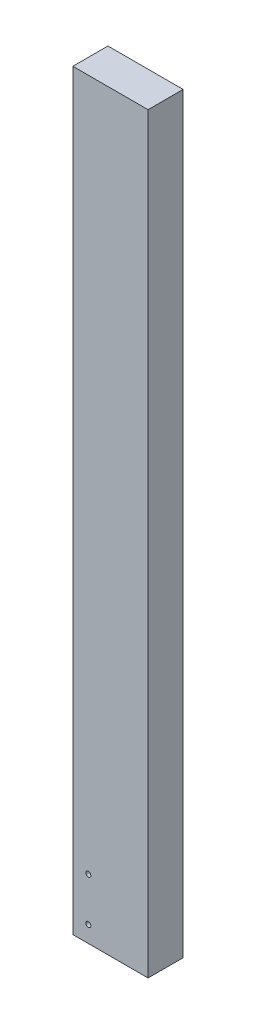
ISO-10303-21;
HEADER;
FILE_DESCRIPTION(('STEP AP214'),'2;1');
FILE_NAME('part.step','',(''),(''),'','','');
FILE_SCHEMA(('AUTOMOTIVE_DESIGN { 1 0 10303 214 1 1 1 1 }'));
ENDSEC;
DATA;
#1=APPLICATION_CONTEXT('core data for automotive mechanical design processes');
#2=APPLICATION_PROTOCOL_DEFINITION('international standard','automotive_design',2000,#1);
#3=PRODUCT_CONTEXT('',#1,'mechanical');
#4=PRODUCT('Part','Part','',(#3));
#5=PRODUCT_RELATED_PRODUCT_CATEGORY('part','',(#4));
#6=PRODUCT_DEFINITION_FORMATION('','',#4);
#7=PRODUCT_DEFINITION_CONTEXT('part definition',#1,'design');
#8=PRODUCT_DEFINITION('design','',#6,#7);
#9=PRODUCT_DEFINITION_SHAPE('','',#8);
#10=(LENGTH_UNIT() NAMED_UNIT(*) SI_UNIT(.MILLI.,.METRE.));
#11=(NAMED_UNIT(*) PLANE_ANGLE_UNIT() SI_UNIT($,.RADIAN.));
#12=(NAMED_UNIT(*) SI_UNIT($,.STERADIAN.) SOLID_ANGLE_UNIT());
#13=UNCERTAINTY_MEASURE_WITH_UNIT(LENGTH_MEASURE(1.E-05),#10,'distance_accuracy_value','');
#14=(GEOMETRIC_REPRESENTATION_CONTEXT(3) GLOBAL_UNCERTAINTY_ASSIGNED_CONTEXT((#13)) GLOBAL_UNIT_ASSIGNED_CONTEXT((#10,
#11,#12)) REPRESENTATION_CONTEXT('',''));
#15=CARTESIAN_POINT('',(0.,0.,0.));
#16=DIRECTION('',(0.,0.,1.));
#17=DIRECTION('',(1.,0.,0.));
#18=AXIS2_PLACEMENT_3D('',#15,#16,#17);
#19=CARTESIAN_POINT('',(-4.52462285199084,15.7611857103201,12.7));
#20=DIRECTION('',(0.,0.,1.));
#21=DIRECTION('',(1.,0.,0.));
#22=AXIS2_PLACEMENT_3D('',#19,#20,#21);
#23=PLANE('',#22);
#24=CARTESIAN_POINT('',(-4.52462285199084,15.7611857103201,12.7));
#25=DIRECTION('',(0.,0.,-1.));
#26=DIRECTION('',(-1.,0.,0.));
#27=AXIS2_PLACEMENT_3D('',#24,#25,#26);
#28=CIRCLE('',#27,1.27000000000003);
#29=CARTESIAN_POINT('',(-5.79462285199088,15.7611857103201,12.7));
#30=VERTEX_POINT('',#29);
#31=EDGE_CURVE('E19',#30,#30,#28,.T.);
#32=ORIENTED_EDGE('',*,*,#31,.T.);
#33=EDGE_LOOP('',(#32));
#34=FACE_BOUND('',#33,.T.);
#35=ADVANCED_FACE('F16',(#34),#23,.F.);
#36=CARTESIAN_POINT('',(-4.52462285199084,166.975093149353,12.7));
#37=DIRECTION('',(0.,0.,1.));
#38=DIRECTION('',(1.,0.,0.));
#39=AXIS2_PLACEMENT_3D('',#36,#37,#38);
#40=PLANE('',#39);
#41=CARTESIAN_POINT('',(-4.52462285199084,166.975093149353,12.7));
#42=DIRECTION('',(0.,0.,-1.));
#43=DIRECTION('',(-1.,0.,0.));
#44=AXIS2_PLACEMENT_3D('',#41,#42,#43);
#45=CIRCLE('',#44,1.27000000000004);
#46=CARTESIAN_POINT('',(-5.79462285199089,166.975093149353,12.7));
#47=VERTEX_POINT('',#46);
#48=EDGE_CURVE('E106',#47,#47,#45,.T.);
#49=ORIENTED_EDGE('',*,*,#48,.T.);
#50=EDGE_LOOP('',(#49));
#51=FACE_BOUND('',#50,.T.);
#52=ADVANCED_FACE('F128',(#51),#40,.F.);
#53=CARTESIAN_POINT('',(-4.52462285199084,316.866822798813,12.7));
#54=DIRECTION('',(0.,0.,1.));
#55=DIRECTION('',(1.,0.,0.));
#56=AXIS2_PLACEMENT_3D('',#53,#54,#55);
#57=PLANE('',#56);
#58=CARTESIAN_POINT('',(-4.52462285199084,316.866822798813,12.7));
#59=DIRECTION('',(0.,0.,-1.));
#60=DIRECTION('',(-1.,0.,0.));
#61=AXIS2_PLACEMENT_3D('',#58,#59,#60);
#62=CIRCLE('',#61,1.27000000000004);
#63=CARTESIAN_POINT('',(-5.79462285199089,316.866822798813,12.7));
#64=VERTEX_POINT('',#63);
#65=EDGE_CURVE('E104',#64,#64,#62,.T.);
#66=ORIENTED_EDGE('',*,*,#65,.T.);
#67=EDGE_LOOP('',(#66));
#68=FACE_BOUND('',#67,.T.);
#69=ADVANCED_FACE('F117',(#68),#57,.F.);
#70=CARTESIAN_POINT('',(-4.52462285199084,15.7611857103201,12.7));
#71=DIRECTION('',(0.,0.,-1.));
#72=DIRECTION('',(-1.,0.,0.));
#73=AXIS2_PLACEMENT_3D('',#70,#71,#72);
#74=CYLINDRICAL_SURFACE('',#73,1.27000000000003);
#75=CARTESIAN_POINT('',(-4.52462285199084,15.7611857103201,6.096));
#76=DIRECTION('',(0.,0.,-1.));
#77=DIRECTION('',(-1.,0.,0.));
#78=AXIS2_PLACEMENT_3D('',#75,#76,#77);
#79=CIRCLE('',#78,1.27000000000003);
#80=CARTESIAN_POINT('',(-5.79462285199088,15.7611857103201,6.096));
#81=VERTEX_POINT('',#80);
#82=EDGE_CURVE('E101',#81,#81,#79,.T.);
#83=ORIENTED_EDGE('',*,*,#82,.T.);
#84=EDGE_LOOP('',(#83));
#85=FACE_BOUND('',#84,.T.);
#86=ORIENTED_EDGE('',*,*,#31,.F.);
#87=EDGE_LOOP('',(#86));
#88=FACE_BOUND('',#87,.T.);
#89=ADVANCED_FACE('F114',(#85,#88),#74,.F.);
#90=CARTESIAN_POINT('',(-4.52462285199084,166.975093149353,12.7));
#91=DIRECTION('',(0.,0.,-1.));
#92=DIRECTION('',(-1.,0.,0.));
#93=AXIS2_PLACEMENT_3D('',#90,#91,#92);
#94=CYLINDRICAL_SURFACE('',#93,1.27000000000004);
#95=CARTESIAN_POINT('',(-4.52462285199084,166.975093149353,6.096));
#96=DIRECTION('',(0.,0.,-1.));
#97=DIRECTION('',(-1.,0.,0.));
#98=AXIS2_PLACEMENT_3D('',#95,#96,#97);
#99=CIRCLE('',#98,1.27000000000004);
#100=CARTESIAN_POINT('',(-5.79462285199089,166.975093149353,6.096));
#101=VERTEX_POINT('',#100);
#102=EDGE_CURVE('E98',#101,#101,#99,.T.);
#103=ORIENTED_EDGE('',*,*,#102,.T.);
#104=EDGE_LOOP('',(#103));
#105=FACE_BOUND('',#104,.T.);
#106=ORIENTED_EDGE('',*,*,#48,.F.);
#107=EDGE_LOOP('',(#106));
#108=FACE_BOUND('',#107,.T.);
#109=ADVANCED_FACE('F116',(#105,#108),#94,.F.);
#110=CARTESIAN_POINT('',(-4.52462285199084,316.866822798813,12.7));
#111=DIRECTION('',(0.,0.,-1.));
#112=DIRECTION('',(-1.,0.,0.));
#113=AXIS2_PLACEMENT_3D('',#110,#111,#112);
#114=CYLINDRICAL_SURFACE('',#113,1.27000000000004);
#115=CARTESIAN_POINT('',(-4.52462285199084,316.866822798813,6.096));
#116=DIRECTION('',(0.,0.,-1.));
#117=DIRECTION('',(-1.,0.,0.));
#118=AXIS2_PLACEMENT_3D('',#115,#116,#117);
#119=CIRCLE('',#118,1.27000000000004);
#120=CARTESIAN_POINT('',(-5.79462285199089,316.866822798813,6.096));
#121=VERTEX_POINT('',#120);
#122=EDGE_CURVE('E95',#121,#121,#119,.T.);
#123=ORIENTED_EDGE('',*,*,#122,.T.);
#124=EDGE_LOOP('',(#123));
#125=FACE_BOUND('',#124,.T.);
#126=ORIENTED_EDGE('',*,*,#65,.F.);
#127=EDGE_LOOP('',(#126));
#128=FACE_BOUND('',#127,.T.);
#129=ADVANCED_FACE('F125',(#125,#128),#114,.F.);
#130=CARTESIAN_POINT('',(0.,0.,6.096));
#131=DIRECTION('',(0.,0.,1.));
#132=DIRECTION('',(1.,0.,0.));
#133=AXIS2_PLACEMENT_3D('',#130,#131,#132);
#134=PLANE('',#133);
#135=DIRECTION('',(0.,1.,0.));
#136=VECTOR('',#135,1.);
#137=CARTESIAN_POINT('',(-19.7646228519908,0.,6.096));
#138=LINE('',#137,#136);
#139=CARTESIAN_POINT('',(-19.7646228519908,-28.2477880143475,6.096));
#140=VERTEX_POINT('',#139);
#141=CARTESIAN_POINT('',(-19.7646228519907,352.752211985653,6.096));
#142=VERTEX_POINT('',#141);
#143=EDGE_CURVE('E89',#140,#142,#138,.T.);
#144=ORIENTED_EDGE('',*,*,#143,.T.);
#145=DIRECTION('',(1.,0.,0.));
#146=VECTOR('',#145,1.);
#147=CARTESIAN_POINT('',(0.,352.752211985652,6.096));
#148=LINE('',#147,#146);
#149=CARTESIAN_POINT('',(18.3353771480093,352.752211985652,6.096));
#150=VERTEX_POINT('',#149);
#151=EDGE_CURVE('E54',#150,#142,#148,.F.);
#152=ORIENTED_EDGE('',*,*,#151,.F.);
#153=DIRECTION('',(0.,1.,0.));
#154=VECTOR('',#153,1.);
#155=CARTESIAN_POINT('',(18.3353771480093,0.,6.096));
#156=LINE('',#155,#154);
#157=CARTESIAN_POINT('',(18.3353771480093,-28.2477880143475,6.096));
#158=VERTEX_POINT('',#157);
#159=EDGE_CURVE('E69',#150,#158,#156,.F.);
#160=ORIENTED_EDGE('',*,*,#159,.T.);
#161=DIRECTION('',(1.,0.,0.));
#162=VECTOR('',#161,1.);
#163=CARTESIAN_POINT('',(0.,-28.2477880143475,6.096));
#164=LINE('',#163,#162);
#165=EDGE_CURVE('E59',#158,#140,#164,.F.);
#166=ORIENTED_EDGE('',*,*,#165,.T.);
#167=EDGE_LOOP('',(#144,#152,#160,#166));
#168=FACE_BOUND('',#167,.T.);
#169=ORIENTED_EDGE('',*,*,#122,.F.);
#170=EDGE_LOOP('',(#169));
#171=FACE_BOUND('',#170,.T.);
#172=ORIENTED_EDGE('',*,*,#102,.F.);
#173=EDGE_LOOP('',(#172));
#174=FACE_BOUND('',#173,.T.);
#175=ORIENTED_EDGE('',*,*,#82,.F.);
#176=EDGE_LOOP('',(#175));
#177=FACE_BOUND('',#176,.T.);
#178=CARTESIAN_POINT('',(-11.9248315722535,-19.8788329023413,6.096));
#179=DIRECTION('',(0.,0.,-1.));
#180=DIRECTION('',(-1.,0.,0.));
#181=AXIS2_PLACEMENT_3D('',#178,#179,#180);
#182=CIRCLE('',#181,1.27);
#183=CARTESIAN_POINT('',(-13.1948315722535,-19.8788329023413,6.096));
#184=VERTEX_POINT('',#183);
#185=EDGE_CURVE('E67',#184,#184,#182,.F.);
#186=ORIENTED_EDGE('',*,*,#185,.T.);
#187=EDGE_LOOP('',(#186));
#188=FACE_BOUND('',#187,.T.);
#189=CARTESIAN_POINT('',(-11.9248315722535,2.18597142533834,6.096));
#190=DIRECTION('',(0.,0.,-1.));
#191=DIRECTION('',(-1.,0.,0.));
#192=AXIS2_PLACEMENT_3D('',#189,#190,#191);
#193=CIRCLE('',#192,1.27);
#194=CARTESIAN_POINT('',(-13.1948315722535,2.18597142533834,6.096));
#195=VERTEX_POINT('',#194);
#196=EDGE_CURVE('E92',#195,#195,#193,.F.);
#197=ORIENTED_EDGE('',*,*,#196,.T.);
#198=EDGE_LOOP('',(#197));
#199=FACE_BOUND('',#198,.T.);
#200=ADVANCED_FACE('F70',(#168,#171,#174,#177,#188,#199),#134,.F.);
#201=CARTESIAN_POINT('',(-11.9248315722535,2.18597142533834,35.56));
#202=DIRECTION('',(0.,0.,-1.));
#203=DIRECTION('',(-1.,0.,0.));
#204=AXIS2_PLACEMENT_3D('',#201,#202,#203);
#205=CYLINDRICAL_SURFACE('',#204,1.27);
#206=CARTESIAN_POINT('',(-11.9248315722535,2.18597142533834,23.876));
#207=DIRECTION('',(0.,0.,-1.));
#208=DIRECTION('',(-1.,0.,0.));
#209=AXIS2_PLACEMENT_3D('',#206,#207,#208);
#210=CIRCLE('',#209,1.27);
#211=CARTESIAN_POINT('',(-13.1948315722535,2.18597142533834,23.876));
#212=VERTEX_POINT('',#211);
#213=EDGE_CURVE('E86',#212,#212,#210,.T.);
#214=ORIENTED_EDGE('',*,*,#213,.F.);
#215=EDGE_LOOP('',(#214));
#216=FACE_BOUND('',#215,.T.);
#217=ORIENTED_EDGE('',*,*,#196,.F.);
#218=EDGE_LOOP('',(#217));
#219=FACE_BOUND('',#218,.T.);
#220=ADVANCED_FACE('F154',(#216,#219),#205,.F.);
#221=CARTESIAN_POINT('',(-11.9248315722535,-19.8788329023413,35.56));
#222=DIRECTION('',(0.,0.,-1.));
#223=DIRECTION('',(-1.,0.,0.));
#224=AXIS2_PLACEMENT_3D('',#221,#222,#223);
#225=CYLINDRICAL_SURFACE('',#224,1.27);
#226=CARTESIAN_POINT('',(-11.9248315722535,-19.8788329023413,23.876));
#227=DIRECTION('',(0.,0.,-1.));
#228=DIRECTION('',(-1.,0.,0.));
#229=AXIS2_PLACEMENT_3D('',#226,#227,#228);
#230=CIRCLE('',#229,1.27);
#231=CARTESIAN_POINT('',(-13.1948315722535,-19.8788329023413,23.876));
#232=VERTEX_POINT('',#231);
#233=EDGE_CURVE('E82',#232,#232,#230,.T.);
#234=ORIENTED_EDGE('',*,*,#233,.F.);
#235=EDGE_LOOP('',(#234));
#236=FACE_BOUND('',#235,.T.);
#237=ORIENTED_EDGE('',*,*,#185,.F.);
#238=EDGE_LOOP('',(#237));
#239=FACE_BOUND('',#238,.T.);
#240=ADVANCED_FACE('F151',(#236,#239),#225,.F.);
#241=CARTESIAN_POINT('',(0.,-28.2477880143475,23.876));
#242=DIRECTION('',(0.,1.,0.));
#243=DIRECTION('',(0.,0.,1.));
#244=AXIS2_PLACEMENT_3D('',#241,#242,#243);
#245=PLANE('',#244);
#246=DIRECTION('',(0.,0.,1.));
#247=VECTOR('',#246,1.);
#248=CARTESIAN_POINT('',(18.3353771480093,-28.2477880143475,23.876));
#249=LINE('',#248,#247);
#250=CARTESIAN_POINT('',(18.3353771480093,-28.2477880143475,23.876));
#251=VERTEX_POINT('',#250);
#252=EDGE_CURVE('E62',#158,#251,#249,.T.);
#253=ORIENTED_EDGE('',*,*,#252,.T.);
#254=DIRECTION('',(1.,0.,0.));
#255=VECTOR('',#254,1.);
#256=CARTESIAN_POINT('',(0.,-28.2477880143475,23.876));
#257=LINE('',#256,#255);
#258=CARTESIAN_POINT('',(-19.7646228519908,-28.2477880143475,23.876));
#259=VERTEX_POINT('',#258);
#260=EDGE_CURVE('E85',#259,#251,#257,.T.);
#261=ORIENTED_EDGE('',*,*,#260,.F.);
#262=DIRECTION('',(0.,0.,-1.));
#263=VECTOR('',#262,1.);
#264=CARTESIAN_POINT('',(-19.7646228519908,-28.2477880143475,23.876));
#265=LINE('',#264,#263);
#266=EDGE_CURVE('E65',#259,#140,#265,.T.);
#267=ORIENTED_EDGE('',*,*,#266,.T.);
#268=ORIENTED_EDGE('',*,*,#165,.F.);
#269=EDGE_LOOP('',(#253,#261,#267,#268));
#270=FACE_BOUND('',#269,.T.);
#271=ADVANCED_FACE('F60',(#270),#245,.F.);
#272=CARTESIAN_POINT('',(18.3353771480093,0.,23.876));
#273=DIRECTION('',(-1.,0.,0.));
#274=DIRECTION('',(0.,0.,1.));
#275=AXIS2_PLACEMENT_3D('',#272,#273,#274);
#276=PLANE('',#275);
#277=DIRECTION('',(0.,0.,1.));
#278=VECTOR('',#277,1.);
#279=CARTESIAN_POINT('',(18.3353771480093,352.752211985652,23.876));
#280=LINE('',#279,#278);
#281=CARTESIAN_POINT('',(18.3353771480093,352.752211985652,23.876));
#282=VERTEX_POINT('',#281);
#283=EDGE_CURVE('E239',#282,#150,#280,.F.);
#284=ORIENTED_EDGE('',*,*,#283,.F.);
#285=DIRECTION('',(0.,1.,0.));
#286=VECTOR('',#285,1.);
#287=CARTESIAN_POINT('',(18.3353771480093,0.,23.876));
#288=LINE('',#287,#286);
#289=EDGE_CURVE('E77',#251,#282,#288,.T.);
#290=ORIENTED_EDGE('',*,*,#289,.F.);
#291=ORIENTED_EDGE('',*,*,#252,.F.);
#292=ORIENTED_EDGE('',*,*,#159,.F.);
#293=EDGE_LOOP('',(#284,#290,#291,#292));
#294=FACE_BOUND('',#293,.T.);
#295=ADVANCED_FACE('F75',(#294),#276,.F.);
#296=CARTESIAN_POINT('',(0.,352.752211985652,23.876));
#297=DIRECTION('',(0.,1.,0.));
#298=DIRECTION('',(0.,0.,1.));
#299=AXIS2_PLACEMENT_3D('',#296,#297,#298);
#300=PLANE('',#299);
#301=DIRECTION('',(1.,0.,0.));
#302=VECTOR('',#301,1.);
#303=CARTESIAN_POINT('',(0.,352.752211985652,23.876));
#304=LINE('',#303,#302);
#305=CARTESIAN_POINT('',(-19.7646228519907,352.752211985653,23.876));
#306=VERTEX_POINT('',#305);
#307=EDGE_CURVE('E25',#282,#306,#304,.F.);
#308=ORIENTED_EDGE('',*,*,#307,.F.);
#309=ORIENTED_EDGE('',*,*,#283,.T.);
#310=ORIENTED_EDGE('',*,*,#151,.T.);
#311=DIRECTION('',(0.,0.,-1.));
#312=VECTOR('',#311,1.);
#313=CARTESIAN_POINT('',(-19.7646228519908,352.752211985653,23.876));
#314=LINE('',#313,#312);
#315=EDGE_CURVE('E34',#142,#306,#314,.F.);
#316=ORIENTED_EDGE('',*,*,#315,.T.);
#317=EDGE_LOOP('',(#308,#309,#310,#316));
#318=FACE_BOUND('',#317,.T.);
#319=ADVANCED_FACE('F139',(#318),#300,.T.);
#320=CARTESIAN_POINT('',(-19.7646228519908,0.,23.876));
#321=DIRECTION('',(1.,0.,0.));
#322=DIRECTION('',(0.,0.,-1.));
#323=AXIS2_PLACEMENT_3D('',#320,#321,#322);
#324=PLANE('',#323);
#325=ORIENTED_EDGE('',*,*,#266,.F.);
#326=DIRECTION('',(0.,1.,0.));
#327=VECTOR('',#326,1.);
#328=CARTESIAN_POINT('',(-19.7646228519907,0.,23.876));
#329=LINE('',#328,#327);
#330=EDGE_CURVE('E10',#306,#259,#329,.F.);
#331=ORIENTED_EDGE('',*,*,#330,.F.);
#332=ORIENTED_EDGE('',*,*,#315,.F.);
#333=ORIENTED_EDGE('',*,*,#143,.F.);
#334=EDGE_LOOP('',(#325,#331,#332,#333));
#335=FACE_BOUND('',#334,.T.);
#336=ADVANCED_FACE('F133',(#335),#324,.F.);
#337=CARTESIAN_POINT('',(0.,0.,23.876));
#338=DIRECTION('',(0.,0.,1.));
#339=DIRECTION('',(1.,0.,0.));
#340=AXIS2_PLACEMENT_3D('',#337,#338,#339);
#341=PLANE('',#340);
#342=ORIENTED_EDGE('',*,*,#307,.T.);
#343=ORIENTED_EDGE('',*,*,#330,.T.);
#344=ORIENTED_EDGE('',*,*,#260,.T.);
#345=ORIENTED_EDGE('',*,*,#289,.T.);
#346=EDGE_LOOP('',(#342,#343,#344,#345));
#347=FACE_BOUND('',#346,.T.);
#348=ORIENTED_EDGE('',*,*,#233,.T.);
#349=EDGE_LOOP('',(#348));
#350=FACE_BOUND('',#349,.T.);
#351=ORIENTED_EDGE('',*,*,#213,.T.);
#352=EDGE_LOOP('',(#351));
#353=FACE_BOUND('',#352,.T.);
#354=ADVANCED_FACE('F131',(#347,#350,#353),#341,.T.);
#355=CLOSED_SHELL('',(#35,#52,#69,#89,#109,#129,#200,#220,#240,#271,#295,#319,#336,#354));
#356=MANIFOLD_SOLID_BREP('B1',#355);
#357=ADVANCED_BREP_SHAPE_REPRESENTATION('',(#18,#356),#14);
#358=SHAPE_DEFINITION_REPRESENTATION(#9,#357);
ENDSEC;
END-ISO-10303-21;
